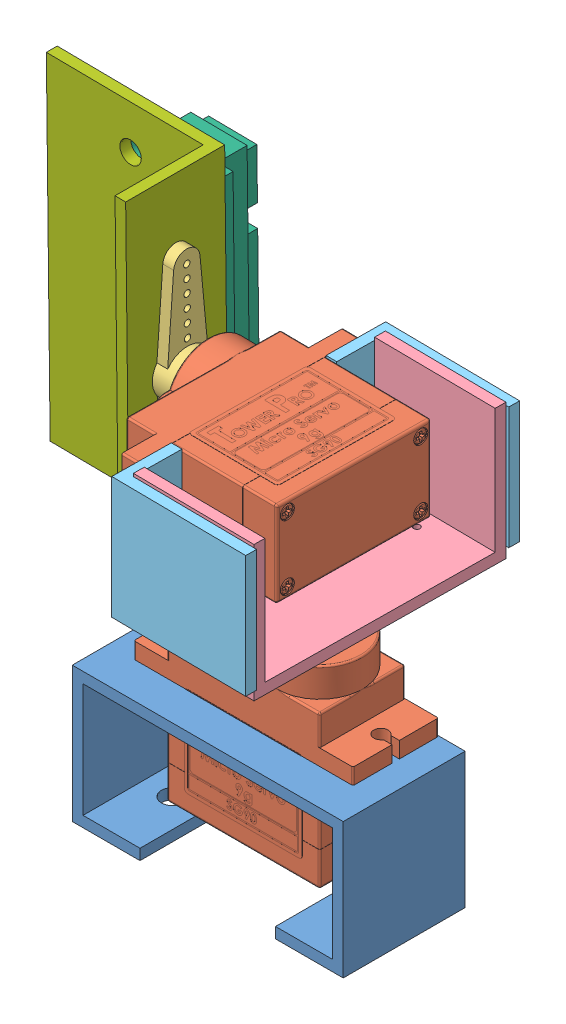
SolidWorks assembly pan-tilt.SLDASM, configuration Default (file format 6000). Lengths in mm.
Overall size (66.42 74 46.58).
11 component instances, 7 part files, 19 mates.
Components (placement in the parent):
- base_bracket-1: base_bracket.SLDPRT [Default] at origin size (40 20 18)
- SG90-1: SG90.SLDASM [Default] at (21.2624 -1.2582 5.3161) size (32.36 31.5 32.31)
  - SG90 BODY-1: SG90 BODY.SLDPRT [Default] at (9.9674 8.0019 -5.2145) size (32.36 29.6 12.65)
  - SG90 ARM-1: SG90 ARM.SLDPRT [Default] at (3.6682 15.3806 1.0847) x (-0.011061 0 0.999939) z (-0.999939 0 -0.011061) size (32.23 4.23 7.24)
- middle_bracket-1: middle_bracket.SLDPRT [Default] at (33.7265 15.7353 24.8992) x (0.011061 0 -0.999939) z (-0.999939 0 -0.011061) size (36.8 20 18)
- SG90-2: SG90.SLDASM [Default] at (15.6132 27.8398 5.0452) x (0.011061 0 -0.999939) z (0 1 0) size (32.36 31.5 32.31)
  - SG90 BODY-1: SG90 BODY.SLDPRT [Default] at (9.9674 8.0019 -5.2145) size (32.36 29.6 12.65)
  - SG90 ARM-1: SG90 ARM.SLDPRT [Default] at (3.6682 15.3806 1.0847) x (-0.011061 0 0.999939) z (-0.999939 0 -0.011061) size (32.23 4.23 7.24)
- top_bracket-1: top_bracket.SLDPRT [Default] at (14.5624 35.3253 -13.7051) x (-0.011061 0 0.999939) z (0 -1 0) size (40 20 18)
- Long Range SHARP IR Sensors - #GP2Y0A21YK0F-1: Long Range SHARP IR Sensors - #GP2Y0A21YK0F.SLDPRT [Default] at (-7.5567 43.6839 0.3544) x (0.000122 -0.999939 -0.011061) z (0.011061 0.011061 -0.999878) size (44.5 18.9 13.5)
- IR mount-1: IR mount.SLDPRT [Default] at (-13.7755 28.9869 -4.59) x (-0.000122 0.999939 0.011061) z (0.011061 0.011061 -0.999878) size (50 25 14.46)
Mates (geometry in assembly coordinates):
- Coincident4: coincident anti-aligned: plane of base_bracket-1 through (0 0 18) normal (0 1 0); plane of SG90-1/SG90 BODY-1 through (36.1447 0 12.7) normal (0 -1 0)
- Coincident5: coincident anti-aligned: plane of base_bracket-1 through (8.7 -10 0) normal (1 0 0); plane of SG90-1/SG90 BODY-1 through (8.7 -15.7607 12.7) normal (-1 0 0)
- Coincident6: coincident anti-aligned: plane of base_bracket-1 through (8.7 -10 12.7) normal (0 0 -1); plane of SG90-1/SG90 BODY-1 through (31.2298 6.7437 12.7) normal (0 0 1)
- Coincident7: coincident anti-aligned: plane of middle_bracket-1 through (16.1347 15.7353 -12.0976) normal (0.011061 0 -0.999939); plane of top_bracket-1 through (34.5436 17.3253 -11.894) normal (-0.011061 0 0.999939)
- Coincident8: coincident anti-aligned: plane of middle_bracket-1 through (15.7276 15.7353 24.7001) normal (-0.999939 0 -0.011061); plane of top_bracket-1 through (16.1347 17.3253 -12.0976) normal (0.999939 0 0.011061)
- Coincident9: coincident anti-aligned: plane of middle_bracket-1 through (15.7452 17.3253 23.1102) normal (0 1 0); plane of top_bracket-1 through (14.5624 17.3253 -13.7051) normal (0 -1 0)
- Coincident10: coincident anti-aligned: plane of SG90-2/SG90 BODY-1 through (7.7221 22.6253 -5.01) normal (0 -1 0); plane of top_bracket-1 through (24.4655 22.6253 -4.895) normal (0 1 0)
- Coincident11: coincident anti-aligned: plane of SG90-2/SG90 BODY-1 through (14.5197 35.2237 -9.8501) normal (0.999939 0 0.011061); plane of top_bracket-1 through (14.5624 17.3253 -13.7051) normal (-0.999939 0 -0.011061)
- Coincident12: coincident anti-aligned: plane of SG90-2/SG90 BODY-1 through (29.9759 35.2237 17.7673) normal (-0.011061 0 0.999939); plane of top_bracket-1 through (24.2155 22.6253 17.7036) normal (0.011061 0 -0.999939)
- Coincident13: coincident anti-aligned: plane of SG90-1/SG90 ARM-1 through (24.9306 15.7353 6.4008) normal (0 1 0); plane of middle_bracket-1 through (15.7276 15.7353 24.7001) normal (0 -1 0)
- Coincident17: coincident anti-aligned: plane of SG90-1/SG90 ARM-1 through (24.9306 15.7353 6.4008) normal (0 1 0); plane of middle_bracket-1 through (15.7276 15.7353 24.7001) normal (0 -1 0)
- Concentric9: concentric anti-aligned: cylinder of SG90-1/SG90 ARM-1 through (25.0875 11.5062 -7.7842) axis (0 1 0) radius 0.4636; cylinder of middle_bracket-1 through (25.0875 25.7353 -7.7842) axis (0 -1 0) radius 0.4636
- Concentric10: concentric anti-aligned: cylinder of SG90-1/SG90 ARM-1 through (24.7737 11.5062 20.5858) axis (0 1 0) radius 0.4636; cylinder of middle_bracket-1 through (24.7737 25.7353 20.5858) axis (0 -1 0) radius 0.4636
- Coincident18: coincident anti-aligned: plane of SG90-2/SG90 ARM-1 through (-1.3387 28.9245 1.1893) normal (-0.999939 0 -0.011061); plane of IR mount-1 through (-1.2587 29.0045 -6.0391) normal (0.999939 0 0.011061)
- Concentric11: concentric anti-aligned: cylinder of SG90-2/SG90 ARM-1 through (2.8884 43.1095 1.393) axis (-0.999939 0 -0.011061) radius 0.4636; cylinder of IR mount-1 through (-2.9278 43.1095 1.3287) axis (0.999939 0 0.011061) radius 0.4636
- Concentric12: concentric anti-aligned: circle of SG90-2/SG90 ARM-1; cylinder of IR mount-1 through (-2.9243 14.7395 1.0148) axis (0.999939 0 0.011061) radius 0.4636
- Coincident21: coincident anti-aligned: plane of Long Range SHARP IR Sensors - #GP2Y0A21YK0F-1 through (-13.7557 10.5056 -6.3819) normal (-0.011061 -0.011061 0.999878); plane of IR mount-1 through (-13.7579 29.0045 -6.1773) normal (0.011061 0.011061 -0.999878)
- Concentric13: concentric aligned: circle of Long Range SHARP IR Sensors - #GP2Y0A21YK0F-1; circle of IR mount-1
- Concentric14: concentric aligned: circle of Long Range SHARP IR Sensors - #GP2Y0A21YK0F-1; circle of IR mount-1
